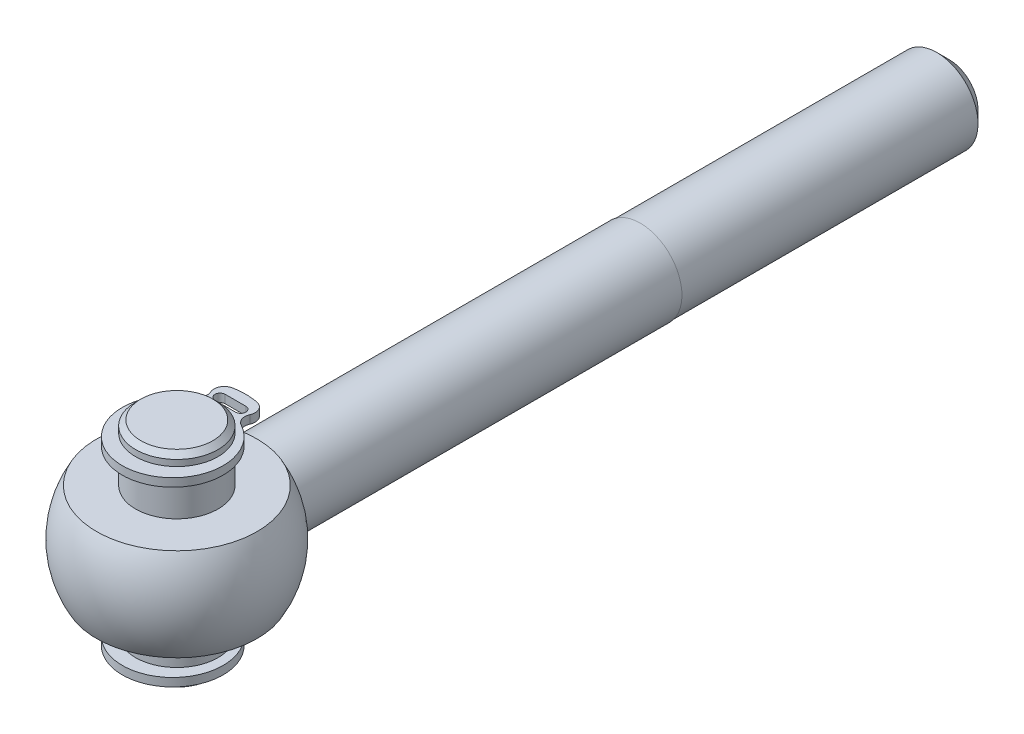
ISO-10303-21;
HEADER;
FILE_DESCRIPTION(('STEP AP214'),'2;1');
FILE_NAME('part.step','',(''),(''),'','','');
FILE_SCHEMA(('AUTOMOTIVE_DESIGN { 1 0 10303 214 1 1 1 1 }'));
ENDSEC;
DATA;
#1=APPLICATION_CONTEXT('core data for automotive mechanical design processes');
#2=APPLICATION_PROTOCOL_DEFINITION('international standard','automotive_design',2000,#1);
#3=PRODUCT_CONTEXT('',#1,'mechanical');
#4=PRODUCT('Part','Part','',(#3));
#5=PRODUCT_RELATED_PRODUCT_CATEGORY('part','',(#4));
#6=PRODUCT_DEFINITION_FORMATION('','',#4);
#7=PRODUCT_DEFINITION_CONTEXT('part definition',#1,'design');
#8=PRODUCT_DEFINITION('design','',#6,#7);
#9=PRODUCT_DEFINITION_SHAPE('','',#8);
#10=(LENGTH_UNIT() NAMED_UNIT(*) SI_UNIT(.MILLI.,.METRE.));
#11=(NAMED_UNIT(*) PLANE_ANGLE_UNIT() SI_UNIT($,.RADIAN.));
#12=(NAMED_UNIT(*) SI_UNIT($,.STERADIAN.) SOLID_ANGLE_UNIT());
#13=UNCERTAINTY_MEASURE_WITH_UNIT(LENGTH_MEASURE(1.E-05),#10,'distance_accuracy_value','');
#14=(GEOMETRIC_REPRESENTATION_CONTEXT(3) GLOBAL_UNCERTAINTY_ASSIGNED_CONTEXT((#13)) GLOBAL_UNIT_ASSIGNED_CONTEXT((#10,
#11,#12)) REPRESENTATION_CONTEXT('',''));
#15=CARTESIAN_POINT('',(0.,0.,0.));
#16=DIRECTION('',(0.,0.,1.));
#17=DIRECTION('',(1.,0.,0.));
#18=AXIS2_PLACEMENT_3D('',#15,#16,#17);
#19=CARTESIAN_POINT('',(1.00001000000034,-8.00000000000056,69.8));
#20=DIRECTION('',(0.,-1.,0.));
#21=DIRECTION('',(0.,0.,-1.));
#22=AXIS2_PLACEMENT_3D('',#19,#20,#21);
#23=CYLINDRICAL_SURFACE('',#22,0.5);
#24=CARTESIAN_POINT('',(1.00001000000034,-8.80000000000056,69.8));
#25=DIRECTION('',(0.,-1.,0.));
#26=DIRECTION('',(0.,0.,-1.));
#27=AXIS2_PLACEMENT_3D('',#24,#25,#26);
#28=CIRCLE('',#27,0.5);
#29=CARTESIAN_POINT('',(0.999999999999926,-8.80000000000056,70.2999999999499));
#30=VERTEX_POINT('',#29);
#31=CARTESIAN_POINT('',(1.00000350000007,-8.80000000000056,69.3000000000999));
#32=VERTEX_POINT('',#31);
#33=EDGE_CURVE('E347',#30,#32,#28,.F.);
#34=ORIENTED_EDGE('',*,*,#33,.F.);
#35=DIRECTION('',(0.,-1.,0.));
#36=VECTOR('',#35,1.);
#37=CARTESIAN_POINT('',(0.999999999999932,-8.00000000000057,70.2999999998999));
#38=LINE('',#37,#36);
#39=CARTESIAN_POINT('',(0.999999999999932,-8.00000000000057,70.2999999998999));
#40=VERTEX_POINT('',#39);
#41=EDGE_CURVE('E289',#40,#30,#38,.T.);
#42=ORIENTED_EDGE('',*,*,#41,.F.);
#43=CARTESIAN_POINT('',(1.00001000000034,-8.00000000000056,69.8));
#44=DIRECTION('',(0.,-1.,0.));
#45=DIRECTION('',(0.,0.,-1.));
#46=AXIS2_PLACEMENT_3D('',#43,#44,#45);
#47=CIRCLE('',#46,0.5);
#48=CARTESIAN_POINT('',(1.00000350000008,-8.00000000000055,69.3000000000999));
#49=VERTEX_POINT('',#48);
#50=EDGE_CURVE('E311',#40,#49,#47,.F.);
#51=ORIENTED_EDGE('',*,*,#50,.T.);
#52=DIRECTION('',(0.,1.,0.));
#53=VECTOR('',#52,1.);
#54=CARTESIAN_POINT('',(0.999999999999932,-8.00000000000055,69.3000000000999));
#55=LINE('',#54,#53);
#56=EDGE_CURVE('E343',#32,#49,#55,.T.);
#57=ORIENTED_EDGE('',*,*,#56,.F.);
#58=EDGE_LOOP('',(#34,#42,#51,#57));
#59=FACE_BOUND('',#58,.T.);
#60=ADVANCED_FACE('F14',(#59),#23,.F.);
#61=CARTESIAN_POINT('',(0.999999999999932,-8.00000000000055,69.3000000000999));
#62=DIRECTION('',(0.,0.,-1.));
#63=DIRECTION('',(0.,1.,0.));
#64=AXIS2_PLACEMENT_3D('',#61,#62,#63);
#65=PLANE('',#64);
#66=ORIENTED_EDGE('',*,*,#56,.T.);
#67=DIRECTION('',(1.,0.,0.));
#68=VECTOR('',#67,1.);
#69=CARTESIAN_POINT('',(0.,-8.00000000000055,69.3000000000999));
#70=LINE('',#69,#68);
#71=CARTESIAN_POINT('',(-1.00000000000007,-8.00000000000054,69.3000000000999));
#72=VERTEX_POINT('',#71);
#73=EDGE_CURVE('E319',#49,#72,#70,.F.);
#74=ORIENTED_EDGE('',*,*,#73,.T.);
#75=DIRECTION('',(0.,-1.,0.));
#76=VECTOR('',#75,1.);
#77=CARTESIAN_POINT('',(-1.00000000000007,-8.00000000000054,69.3000000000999));
#78=LINE('',#77,#76);
#79=CARTESIAN_POINT('',(-1.00000000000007,-8.80000000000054,69.3000000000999));
#80=VERTEX_POINT('',#79);
#81=EDGE_CURVE('E275',#72,#80,#78,.T.);
#82=ORIENTED_EDGE('',*,*,#81,.T.);
#83=DIRECTION('',(1.,0.,0.));
#84=VECTOR('',#83,1.);
#85=CARTESIAN_POINT('',(0.999999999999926,-8.80000000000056,69.3000000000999));
#86=LINE('',#85,#84);
#87=EDGE_CURVE('E272',#32,#80,#86,.F.);
#88=ORIENTED_EDGE('',*,*,#87,.F.);
#89=EDGE_LOOP('',(#66,#74,#82,#88));
#90=FACE_BOUND('',#89,.T.);
#91=ADVANCED_FACE('F486',(#90),#65,.F.);
#92=CARTESIAN_POINT('',(-1.00001000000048,-8.00000000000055,69.8));
#93=DIRECTION('',(0.,-1.,0.));
#94=DIRECTION('',(0.,0.,-1.));
#95=AXIS2_PLACEMENT_3D('',#92,#93,#94);
#96=CYLINDRICAL_SURFACE('',#95,0.5);
#97=CARTESIAN_POINT('',(-1.00001000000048,-8.80000000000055,69.8));
#98=DIRECTION('',(0.,-1.,0.));
#99=DIRECTION('',(0.,0.,-1.));
#100=AXIS2_PLACEMENT_3D('',#97,#98,#99);
#101=CIRCLE('',#100,0.5);
#102=CARTESIAN_POINT('',(-1.00001650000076,-8.80000000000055,70.2999999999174));
#103=VERTEX_POINT('',#102);
#104=EDGE_CURVE('E281',#80,#103,#101,.F.);
#105=ORIENTED_EDGE('',*,*,#104,.F.);
#106=ORIENTED_EDGE('',*,*,#81,.F.);
#107=CARTESIAN_POINT('',(-1.00001000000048,-8.00000000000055,69.8));
#108=DIRECTION('',(0.,-1.,0.));
#109=DIRECTION('',(0.,0.,-1.));
#110=AXIS2_PLACEMENT_3D('',#107,#108,#109);
#111=CIRCLE('',#110,0.5);
#112=CARTESIAN_POINT('',(-1.00001650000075,-8.00000000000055,70.2999999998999));
#113=VERTEX_POINT('',#112);
#114=EDGE_CURVE('E316',#72,#113,#111,.F.);
#115=ORIENTED_EDGE('',*,*,#114,.T.);
#116=DIRECTION('',(0.,-1.,0.));
#117=VECTOR('',#116,1.);
#118=CARTESIAN_POINT('',(-1.0000200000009,-8.00000000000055,70.2999999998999));
#119=LINE('',#118,#117);
#120=EDGE_CURVE('E290',#113,#103,#119,.T.);
#121=ORIENTED_EDGE('',*,*,#120,.T.);
#122=EDGE_LOOP('',(#105,#106,#115,#121));
#123=FACE_BOUND('',#122,.T.);
#124=ADVANCED_FACE('F493',(#123),#96,.F.);
#125=CARTESIAN_POINT('',(0.,-8.00000000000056,70.3));
#126=DIRECTION('',(0.,0.,1.));
#127=DIRECTION('',(0.,-1.,0.));
#128=AXIS2_PLACEMENT_3D('',#125,#126,#127);
#129=PLANE('',#128);
#130=ORIENTED_EDGE('',*,*,#120,.F.);
#131=DIRECTION('',(1.,0.,0.));
#132=VECTOR('',#131,1.);
#133=CARTESIAN_POINT('',(0.,-8.00000000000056,70.2999999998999));
#134=LINE('',#133,#132);
#135=EDGE_CURVE('E315',#113,#40,#134,.T.);
#136=ORIENTED_EDGE('',*,*,#135,.T.);
#137=ORIENTED_EDGE('',*,*,#41,.T.);
#138=DIRECTION('',(1.,0.,0.));
#139=VECTOR('',#138,1.);
#140=CARTESIAN_POINT('',(0.,-8.80000000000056,70.3));
#141=LINE('',#140,#139);
#142=EDGE_CURVE('E287',#103,#30,#141,.T.);
#143=ORIENTED_EDGE('',*,*,#142,.F.);
#144=EDGE_LOOP('',(#130,#136,#137,#143));
#145=FACE_BOUND('',#144,.T.);
#146=ADVANCED_FACE('F499',(#145),#129,.F.);
#147=CARTESIAN_POINT('',(0.,-8.00000000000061,75.));
#148=DIRECTION('',(0.,-1.,0.));
#149=DIRECTION('',(0.,0.,-1.));
#150=AXIS2_PLACEMENT_3D('',#147,#148,#149);
#151=CYLINDRICAL_SURFACE('',#150,6.69621283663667);
#152=CARTESIAN_POINT('',(0.,-8.00000000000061,75.));
#153=DIRECTION('',(0.,-1.,0.));
#154=DIRECTION('',(0.,0.,-1.));
#155=AXIS2_PLACEMENT_3D('',#152,#153,#154);
#156=CIRCLE('',#155,6.69621283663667);
#157=CARTESIAN_POINT('',(-1.17555523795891,-8.00000000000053,68.40778214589));
#158=VERTEX_POINT('',#157);
#159=CARTESIAN_POINT('',(-0.250000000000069,-8.00000000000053,68.3084556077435));
#160=VERTEX_POINT('',#159);
#161=EDGE_CURVE('E291',#158,#160,#156,.T.);
#162=ORIENTED_EDGE('',*,*,#161,.T.);
#163=DIRECTION('',(0.,-1.,0.));
#164=VECTOR('',#163,1.);
#165=CARTESIAN_POINT('',(-0.250000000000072,-8.00000000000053,68.3084556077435));
#166=LINE('',#165,#164);
#167=CARTESIAN_POINT('',(-0.250000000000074,-8.80000000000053,68.3084556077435));
#168=VERTEX_POINT('',#167);
#169=EDGE_CURVE('E592',#160,#168,#166,.T.);
#170=ORIENTED_EDGE('',*,*,#169,.T.);
#171=CARTESIAN_POINT('',(-1.05668095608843E-13,-8.80000000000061,75.));
#172=DIRECTION('',(0.,-1.,0.));
#173=DIRECTION('',(0.,0.,-1.));
#174=AXIS2_PLACEMENT_3D('',#171,#172,#173);
#175=CIRCLE('',#174,6.69621283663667);
#176=CARTESIAN_POINT('',(-1.17555523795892,-8.80000000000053,68.4077821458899));
#177=VERTEX_POINT('',#176);
#178=EDGE_CURVE('E320',#168,#177,#175,.F.);
#179=ORIENTED_EDGE('',*,*,#178,.T.);
#180=DIRECTION('',(0.,-1.,0.));
#181=VECTOR('',#180,1.);
#182=CARTESIAN_POINT('',(-1.17555523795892,-8.00000000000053,68.40778214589));
#183=LINE('',#182,#181);
#184=EDGE_CURVE('E31',#177,#158,#183,.F.);
#185=ORIENTED_EDGE('',*,*,#184,.T.);
#186=EDGE_LOOP('',(#162,#170,#179,#185));
#187=FACE_BOUND('',#186,.T.);
#188=ADVANCED_FACE('F505',(#187),#151,.T.);
#189=CARTESIAN_POINT('',(-0.250000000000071,-8.40000000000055,69.8));
#190=DIRECTION('',(1.,0.,0.));
#191=DIRECTION('',(0.,0.,-1.));
#192=AXIS2_PLACEMENT_3D('',#189,#190,#191);
#193=PLANE('',#192);
#194=DIRECTION('',(0.,0.,-1.));
#195=VECTOR('',#194,1.);
#196=CARTESIAN_POINT('',(-0.250000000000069,-8.0000000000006,73.9825245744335));
#197=LINE('',#196,#195);
#198=CARTESIAN_POINT('',(-0.250000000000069,-8.00000000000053,68.3));
#199=VERTEX_POINT('',#198);
#200=EDGE_CURVE('E314',#160,#199,#197,.T.);
#201=ORIENTED_EDGE('',*,*,#200,.T.);
#202=DIRECTION('',(0.,1.,0.));
#203=VECTOR('',#202,1.);
#204=CARTESIAN_POINT('',(-0.250000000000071,-8.40000000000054,68.3));
#205=LINE('',#204,#203);
#206=CARTESIAN_POINT('',(-0.250000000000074,-8.80000000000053,68.3));
#207=VERTEX_POINT('',#206);
#208=EDGE_CURVE('E619',#199,#207,#205,.F.);
#209=ORIENTED_EDGE('',*,*,#208,.T.);
#210=DIRECTION('',(0.,0.,-1.));
#211=VECTOR('',#210,1.);
#212=CARTESIAN_POINT('',(-0.250000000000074,-8.80000000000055,69.8));
#213=LINE('',#212,#211);
#214=EDGE_CURVE('E346',#168,#207,#213,.T.);
#215=ORIENTED_EDGE('',*,*,#214,.F.);
#216=ORIENTED_EDGE('',*,*,#169,.F.);
#217=EDGE_LOOP('',(#201,#209,#215,#216));
#218=FACE_BOUND('',#217,.T.);
#219=ADVANCED_FACE('F501',(#218),#193,.F.);
#220=CARTESIAN_POINT('',(0.,-8.40000000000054,68.3));
#221=DIRECTION('',(0.,0.,1.));
#222=DIRECTION('',(1.,0.,0.));
#223=AXIS2_PLACEMENT_3D('',#220,#221,#222);
#224=PLANE('',#223);
#225=DIRECTION('',(1.,0.,0.));
#226=VECTOR('',#225,1.);
#227=CARTESIAN_POINT('',(0.,-8.80000000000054,68.3));
#228=LINE('',#227,#226);
#229=CARTESIAN_POINT('',(0.249999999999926,-8.80000000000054,68.3));
#230=VERTEX_POINT('',#229);
#231=EDGE_CURVE('E611',#207,#230,#228,.T.);
#232=ORIENTED_EDGE('',*,*,#231,.F.);
#233=ORIENTED_EDGE('',*,*,#208,.F.);
#234=DIRECTION('',(1.,0.,0.));
#235=VECTOR('',#234,1.);
#236=CARTESIAN_POINT('',(0.,-8.00000000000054,68.3));
#237=LINE('',#236,#235);
#238=CARTESIAN_POINT('',(0.249999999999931,-8.00000000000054,68.3));
#239=VERTEX_POINT('',#238);
#240=EDGE_CURVE('E614',#199,#239,#237,.T.);
#241=ORIENTED_EDGE('',*,*,#240,.T.);
#242=DIRECTION('',(0.,1.,0.));
#243=VECTOR('',#242,1.);
#244=CARTESIAN_POINT('',(0.249999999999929,-8.40000000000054,68.3));
#245=LINE('',#244,#243);
#246=EDGE_CURVE('E608',#239,#230,#245,.F.);
#247=ORIENTED_EDGE('',*,*,#246,.T.);
#248=EDGE_LOOP('',(#232,#233,#241,#247));
#249=FACE_BOUND('',#248,.T.);
#250=ADVANCED_FACE('F504',(#249),#224,.F.);
#251=CARTESIAN_POINT('',(0.249999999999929,-8.40000000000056,69.8));
#252=DIRECTION('',(-1.,0.,0.));
#253=DIRECTION('',(0.,0.,1.));
#254=AXIS2_PLACEMENT_3D('',#251,#252,#253);
#255=PLANE('',#254);
#256=DIRECTION('',(0.,0.,1.));
#257=VECTOR('',#256,1.);
#258=CARTESIAN_POINT('',(0.249999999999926,-8.80000000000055,69.8));
#259=LINE('',#258,#257);
#260=CARTESIAN_POINT('',(0.249999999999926,-8.80000000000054,68.3084556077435));
#261=VERTEX_POINT('',#260);
#262=EDGE_CURVE('E342',#230,#261,#259,.T.);
#263=ORIENTED_EDGE('',*,*,#262,.F.);
#264=ORIENTED_EDGE('',*,*,#246,.F.);
#265=DIRECTION('',(0.,0.,-1.));
#266=VECTOR('',#265,1.);
#267=CARTESIAN_POINT('',(0.249999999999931,-8.0000000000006,73.9825245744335));
#268=LINE('',#267,#266);
#269=CARTESIAN_POINT('',(0.249999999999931,-8.00000000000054,68.3084556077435));
#270=VERTEX_POINT('',#269);
#271=EDGE_CURVE('E310',#239,#270,#268,.F.);
#272=ORIENTED_EDGE('',*,*,#271,.T.);
#273=DIRECTION('',(0.,-1.,0.));
#274=VECTOR('',#273,1.);
#275=CARTESIAN_POINT('',(0.249999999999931,-8.00000000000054,68.3084556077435));
#276=LINE('',#275,#274);
#277=EDGE_CURVE('E339',#261,#270,#276,.F.);
#278=ORIENTED_EDGE('',*,*,#277,.F.);
#279=EDGE_LOOP('',(#263,#264,#272,#278));
#280=FACE_BOUND('',#279,.T.);
#281=ADVANCED_FACE('F509',(#280),#255,.F.);
#282=CARTESIAN_POINT('',(0.,-8.00000000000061,75.));
#283=DIRECTION('',(0.,-1.,0.));
#284=DIRECTION('',(0.,0.,-1.));
#285=AXIS2_PLACEMENT_3D('',#282,#283,#284);
#286=CYLINDRICAL_SURFACE('',#285,6.69621283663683);
#287=CARTESIAN_POINT('',(0.,-8.00000000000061,75.));
#288=DIRECTION('',(0.,-1.,0.));
#289=DIRECTION('',(0.,0.,-1.));
#290=AXIS2_PLACEMENT_3D('',#287,#288,#289);
#291=CIRCLE('',#290,6.69621283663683);
#292=CARTESIAN_POINT('',(1.17555523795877,-8.00000000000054,68.4077821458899));
#293=VERTEX_POINT('',#292);
#294=EDGE_CURVE('E307',#270,#293,#291,.T.);
#295=ORIENTED_EDGE('',*,*,#294,.T.);
#296=DIRECTION('',(0.,-1.,0.));
#297=VECTOR('',#296,1.);
#298=CARTESIAN_POINT('',(1.17555523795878,-8.00000000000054,68.40778214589));
#299=LINE('',#298,#297);
#300=CARTESIAN_POINT('',(1.17555523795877,-8.80000000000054,68.4077821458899));
#301=VERTEX_POINT('',#300);
#302=EDGE_CURVE('E338',#301,#293,#299,.F.);
#303=ORIENTED_EDGE('',*,*,#302,.F.);
#304=CARTESIAN_POINT('',(0.,-8.80000000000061,75.));
#305=DIRECTION('',(0.,-1.,0.));
#306=DIRECTION('',(0.,0.,-1.));
#307=AXIS2_PLACEMENT_3D('',#304,#305,#306);
#308=CIRCLE('',#307,6.69621283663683);
#309=EDGE_CURVE('E340',#301,#261,#308,.F.);
#310=ORIENTED_EDGE('',*,*,#309,.T.);
#311=ORIENTED_EDGE('',*,*,#277,.T.);
#312=EDGE_LOOP('',(#295,#303,#310,#311));
#313=FACE_BOUND('',#312,.T.);
#314=ADVANCED_FACE('F513',(#313),#286,.T.);
#315=CARTESIAN_POINT('',(0.999999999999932,-8.00000000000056,69.3922517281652));
#316=DIRECTION('',(0.,-1.,0.));
#317=DIRECTION('',(0.,0.,-1.));
#318=AXIS2_PLACEMENT_3D('',#315,#316,#317);
#319=CYLINDRICAL_SURFACE('',#318,1.);
#320=CARTESIAN_POINT('',(0.999999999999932,-8.00000000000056,69.3922517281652));
#321=DIRECTION('',(0.,-1.,0.));
#322=DIRECTION('',(0.,0.,-1.));
#323=AXIS2_PLACEMENT_3D('',#320,#321,#322);
#324=CIRCLE('',#323,1.);
#325=CARTESIAN_POINT('',(1.91071061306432,-8.00000000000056,69.8052967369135));
#326=VERTEX_POINT('',#325);
#327=EDGE_CURVE('E304',#293,#326,#324,.T.);
#328=ORIENTED_EDGE('',*,*,#327,.T.);
#329=DIRECTION('',(0.,-1.,0.));
#330=VECTOR('',#329,1.);
#331=CARTESIAN_POINT('',(1.91071061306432,-8.00000000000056,69.8052967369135));
#332=LINE('',#331,#330);
#333=CARTESIAN_POINT('',(1.91071061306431,-8.80000000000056,69.8052967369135));
#334=VERTEX_POINT('',#333);
#335=EDGE_CURVE('E335',#326,#334,#332,.T.);
#336=ORIENTED_EDGE('',*,*,#335,.T.);
#337=CARTESIAN_POINT('',(0.999999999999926,-8.80000000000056,69.3922517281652));
#338=DIRECTION('',(0.,-1.,0.));
#339=DIRECTION('',(0.,0.,-1.));
#340=AXIS2_PLACEMENT_3D('',#337,#338,#339);
#341=CIRCLE('',#340,1.);
#342=EDGE_CURVE('E336',#334,#301,#341,.F.);
#343=ORIENTED_EDGE('',*,*,#342,.T.);
#344=ORIENTED_EDGE('',*,*,#302,.T.);
#345=EDGE_LOOP('',(#328,#336,#343,#344));
#346=FACE_BOUND('',#345,.T.);
#347=ADVANCED_FACE('F517',(#346),#319,.T.);
#348=CARTESIAN_POINT('',(2.8214212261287,-8.00000000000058,70.2183417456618));
#349=DIRECTION('',(0.,-1.,0.));
#350=DIRECTION('',(0.,0.,-1.));
#351=AXIS2_PLACEMENT_3D('',#348,#349,#350);
#352=CYLINDRICAL_SURFACE('',#351,1.);
#353=ORIENTED_EDGE('',*,*,#335,.F.);
#354=CARTESIAN_POINT('',(2.8214212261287,-8.00000000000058,70.2183417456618));
#355=DIRECTION('',(0.,-1.,0.));
#356=DIRECTION('',(0.,0.,-1.));
#357=AXIS2_PLACEMENT_3D('',#354,#355,#356);
#358=CIRCLE('',#357,1.);
#359=CARTESIAN_POINT('',(2.34321423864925,-8.00000000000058,71.0965889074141));
#360=VERTEX_POINT('',#359);
#361=EDGE_CURVE('E301',#326,#360,#358,.F.);
#362=ORIENTED_EDGE('',*,*,#361,.T.);
#363=DIRECTION('',(0.,-1.,0.));
#364=VECTOR('',#363,1.);
#365=CARTESIAN_POINT('',(2.34321423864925,-8.00000000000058,71.0965889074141));
#366=LINE('',#365,#364);
#367=CARTESIAN_POINT('',(2.34321423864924,-8.80000000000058,71.0965889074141));
#368=VERTEX_POINT('',#367);
#369=EDGE_CURVE('E331',#368,#360,#366,.F.);
#370=ORIENTED_EDGE('',*,*,#369,.F.);
#371=CARTESIAN_POINT('',(2.8214212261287,-8.80000000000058,70.2183417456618));
#372=DIRECTION('',(0.,-1.,0.));
#373=DIRECTION('',(0.,0.,-1.));
#374=AXIS2_PLACEMENT_3D('',#371,#372,#373);
#375=CIRCLE('',#374,1.);
#376=EDGE_CURVE('E332',#334,#368,#375,.F.);
#377=ORIENTED_EDGE('',*,*,#376,.F.);
#378=EDGE_LOOP('',(#353,#362,#370,#377));
#379=FACE_BOUND('',#378,.T.);
#380=ADVANCED_FACE('F521',(#379),#352,.F.);
#381=CARTESIAN_POINT('',(0.,-8.00000000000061,75.4));
#382=DIRECTION('',(0.,-1.,0.));
#383=DIRECTION('',(0.,0.,-1.));
#384=AXIS2_PLACEMENT_3D('',#381,#382,#383);
#385=CYLINDRICAL_SURFACE('',#384,4.9);
#386=DIRECTION('',(0.,-1.,0.));
#387=VECTOR('',#386,1.);
#388=CARTESIAN_POINT('',(-2.3432142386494,-8.00000000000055,71.0965889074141));
#389=LINE('',#388,#387);
#390=CARTESIAN_POINT('',(-2.3432142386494,-8.00000000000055,71.0965889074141));
#391=VERTEX_POINT('',#390);
#392=CARTESIAN_POINT('',(-2.3432142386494,-8.80000000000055,71.0965889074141));
#393=VERTEX_POINT('',#392);
#394=EDGE_CURVE('E328',#391,#393,#389,.T.);
#395=ORIENTED_EDGE('',*,*,#394,.T.);
#396=CARTESIAN_POINT('',(0.,-8.80000000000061,75.4));
#397=DIRECTION('',(0.,-1.,0.));
#398=DIRECTION('',(0.,0.,-1.));
#399=AXIS2_PLACEMENT_3D('',#396,#397,#398);
#400=CIRCLE('',#399,4.9);
#401=EDGE_CURVE('E329',#393,#368,#400,.F.);
#402=ORIENTED_EDGE('',*,*,#401,.T.);
#403=ORIENTED_EDGE('',*,*,#369,.T.);
#404=CARTESIAN_POINT('',(0.,-8.00000000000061,75.4));
#405=DIRECTION('',(0.,-1.,0.));
#406=DIRECTION('',(0.,0.,-1.));
#407=AXIS2_PLACEMENT_3D('',#404,#405,#406);
#408=CIRCLE('',#407,4.9);
#409=EDGE_CURVE('E299',#360,#391,#408,.T.);
#410=ORIENTED_EDGE('',*,*,#409,.T.);
#411=EDGE_LOOP('',(#395,#402,#403,#410));
#412=FACE_BOUND('',#411,.T.);
#413=ADVANCED_FACE('F525',(#412),#385,.T.);
#414=CARTESIAN_POINT('',(-2.82142122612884,-8.00000000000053,70.2183417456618));
#415=DIRECTION('',(0.,-1.,0.));
#416=DIRECTION('',(0.,0.,-1.));
#417=AXIS2_PLACEMENT_3D('',#414,#415,#416);
#418=CYLINDRICAL_SURFACE('',#417,1.);
#419=ORIENTED_EDGE('',*,*,#394,.F.);
#420=CARTESIAN_POINT('',(-2.82142122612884,-8.00000000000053,70.2183417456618));
#421=DIRECTION('',(0.,-1.,0.));
#422=DIRECTION('',(0.,0.,-1.));
#423=AXIS2_PLACEMENT_3D('',#420,#421,#422);
#424=CIRCLE('',#423,1.);
#425=CARTESIAN_POINT('',(-1.91071061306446,-8.00000000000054,69.8052967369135));
#426=VERTEX_POINT('',#425);
#427=EDGE_CURVE('E296',#391,#426,#424,.F.);
#428=ORIENTED_EDGE('',*,*,#427,.T.);
#429=DIRECTION('',(0.,-1.,0.));
#430=VECTOR('',#429,1.);
#431=CARTESIAN_POINT('',(-1.91071061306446,-8.00000000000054,69.8052967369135));
#432=LINE('',#431,#430);
#433=CARTESIAN_POINT('',(-1.91071061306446,-8.80000000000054,69.8052967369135));
#434=VERTEX_POINT('',#433);
#435=EDGE_CURVE('E322',#434,#426,#432,.F.);
#436=ORIENTED_EDGE('',*,*,#435,.F.);
#437=CARTESIAN_POINT('',(-2.82142122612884,-8.80000000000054,70.2183417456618));
#438=DIRECTION('',(0.,-1.,0.));
#439=DIRECTION('',(0.,0.,-1.));
#440=AXIS2_PLACEMENT_3D('',#437,#438,#439);
#441=CIRCLE('',#440,1.);
#442=EDGE_CURVE('E325',#393,#434,#441,.F.);
#443=ORIENTED_EDGE('',*,*,#442,.F.);
#444=EDGE_LOOP('',(#419,#428,#436,#443));
#445=FACE_BOUND('',#444,.T.);
#446=ADVANCED_FACE('F529',(#445),#418,.F.);
#447=CARTESIAN_POINT('',(-1.00000000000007,-8.00000000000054,69.3922517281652));
#448=DIRECTION('',(0.,-1.,0.));
#449=DIRECTION('',(0.,0.,-1.));
#450=AXIS2_PLACEMENT_3D('',#447,#448,#449);
#451=CYLINDRICAL_SURFACE('',#450,1.);
#452=CARTESIAN_POINT('',(-1.00000000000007,-8.00000000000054,69.3922517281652));
#453=DIRECTION('',(0.,-1.,0.));
#454=DIRECTION('',(0.,0.,-1.));
#455=AXIS2_PLACEMENT_3D('',#452,#453,#454);
#456=CIRCLE('',#455,1.);
#457=EDGE_CURVE('E293',#426,#158,#456,.T.);
#458=ORIENTED_EDGE('',*,*,#457,.T.);
#459=ORIENTED_EDGE('',*,*,#184,.F.);
#460=CARTESIAN_POINT('',(-1.00000000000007,-8.80000000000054,69.3922517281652));
#461=DIRECTION('',(0.,-1.,0.));
#462=DIRECTION('',(0.,0.,-1.));
#463=AXIS2_PLACEMENT_3D('',#460,#461,#462);
#464=CIRCLE('',#463,1.);
#465=EDGE_CURVE('E323',#177,#434,#464,.F.);
#466=ORIENTED_EDGE('',*,*,#465,.T.);
#467=ORIENTED_EDGE('',*,*,#435,.T.);
#468=EDGE_LOOP('',(#458,#459,#466,#467));
#469=FACE_BOUND('',#468,.T.);
#470=ADVANCED_FACE('F533',(#469),#451,.T.);
#471=CARTESIAN_POINT('',(0.,-8.0000000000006,73.9825245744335));
#472=DIRECTION('',(0.,-1.,0.));
#473=DIRECTION('',(0.,0.,-1.));
#474=AXIS2_PLACEMENT_3D('',#471,#472,#473);
#475=PLANE('',#474);
#476=CARTESIAN_POINT('',(0.,-8.00000000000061,75.));
#477=DIRECTION('',(0.,-1.,0.));
#478=DIRECTION('',(0.,0.,1.));
#479=AXIS2_PLACEMENT_3D('',#476,#477,#478);
#480=CIRCLE('',#479,4.);
#481=CARTESIAN_POINT('',(0.,-8.00000000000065,79.));
#482=VERTEX_POINT('',#481);
#483=EDGE_CURVE('E23',#482,#482,#480,.T.);
#484=ORIENTED_EDGE('',*,*,#483,.T.);
#485=EDGE_LOOP('',(#484));
#486=FACE_BOUND('',#485,.T.);
#487=ORIENTED_EDGE('',*,*,#457,.F.);
#488=ORIENTED_EDGE('',*,*,#427,.F.);
#489=ORIENTED_EDGE('',*,*,#409,.F.);
#490=ORIENTED_EDGE('',*,*,#361,.F.);
#491=ORIENTED_EDGE('',*,*,#327,.F.);
#492=ORIENTED_EDGE('',*,*,#294,.F.);
#493=ORIENTED_EDGE('',*,*,#271,.F.);
#494=ORIENTED_EDGE('',*,*,#240,.F.);
#495=ORIENTED_EDGE('',*,*,#200,.F.);
#496=ORIENTED_EDGE('',*,*,#161,.F.);
#497=EDGE_LOOP('',(#487,#488,#489,#490,#491,#492,#493,#494,#495,#496));
#498=FACE_BOUND('',#497,.T.);
#499=ORIENTED_EDGE('',*,*,#135,.F.);
#500=ORIENTED_EDGE('',*,*,#114,.F.);
#501=ORIENTED_EDGE('',*,*,#73,.F.);
#502=ORIENTED_EDGE('',*,*,#50,.F.);
#503=EDGE_LOOP('',(#499,#500,#501,#502));
#504=FACE_BOUND('',#503,.T.);
#505=ADVANCED_FACE('F537',(#486,#498,#504),#475,.F.);
#506=CARTESIAN_POINT('',(0.,-8.8000000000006,73.9825245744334));
#507=DIRECTION('',(0.,-1.,0.));
#508=DIRECTION('',(0.,0.,-1.));
#509=AXIS2_PLACEMENT_3D('',#506,#507,#508);
#510=PLANE('',#509);
#511=CARTESIAN_POINT('',(0.,-8.80000000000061,75.));
#512=DIRECTION('',(0.,-1.,0.));
#513=DIRECTION('',(0.,0.,1.));
#514=AXIS2_PLACEMENT_3D('',#511,#512,#513);
#515=CIRCLE('',#514,3.8);
#516=CARTESIAN_POINT('',(0.,-8.80000000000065,78.8));
#517=VERTEX_POINT('',#516);
#518=EDGE_CURVE('E9',#517,#517,#515,.T.);
#519=ORIENTED_EDGE('',*,*,#518,.F.);
#520=EDGE_LOOP('',(#519));
#521=FACE_BOUND('',#520,.T.);
#522=ORIENTED_EDGE('',*,*,#465,.F.);
#523=ORIENTED_EDGE('',*,*,#178,.F.);
#524=ORIENTED_EDGE('',*,*,#214,.T.);
#525=ORIENTED_EDGE('',*,*,#231,.T.);
#526=ORIENTED_EDGE('',*,*,#262,.T.);
#527=ORIENTED_EDGE('',*,*,#309,.F.);
#528=ORIENTED_EDGE('',*,*,#342,.F.);
#529=ORIENTED_EDGE('',*,*,#376,.T.);
#530=ORIENTED_EDGE('',*,*,#401,.F.);
#531=ORIENTED_EDGE('',*,*,#442,.T.);
#532=EDGE_LOOP('',(#522,#523,#524,#525,#526,#527,#528,#529,#530,#531));
#533=FACE_BOUND('',#532,.T.);
#534=ORIENTED_EDGE('',*,*,#104,.T.);
#535=ORIENTED_EDGE('',*,*,#142,.T.);
#536=ORIENTED_EDGE('',*,*,#33,.T.);
#537=ORIENTED_EDGE('',*,*,#87,.T.);
#538=EDGE_LOOP('',(#534,#535,#536,#537));
#539=FACE_BOUND('',#538,.T.);
#540=ADVANCED_FACE('F542',(#521,#533,#539),#510,.T.);
#541=CARTESIAN_POINT('',(0.,10.,75.));
#542=DIRECTION('',(0.,1.,0.));
#543=DIRECTION('',(0.,0.,-1.));
#544=AXIS2_PLACEMENT_3D('',#541,#542,#543);
#545=PLANE('',#544);
#546=CARTESIAN_POINT('',(0.,10.,75.));
#547=DIRECTION('',(0.,1.,0.));
#548=DIRECTION('',(0.,0.,-1.));
#549=AXIS2_PLACEMENT_3D('',#546,#547,#548);
#550=CIRCLE('',#549,3.5);
#551=CARTESIAN_POINT('',(0.,10.,71.5));
#552=VERTEX_POINT('',#551);
#553=EDGE_CURVE('E240',#552,#552,#550,.T.);
#554=ORIENTED_EDGE('',*,*,#553,.T.);
#555=EDGE_LOOP('',(#554));
#556=FACE_BOUND('',#555,.T.);
#557=ADVANCED_FACE('F565',(#556),#545,.T.);
#558=CARTESIAN_POINT('',(0.,10.,75.));
#559=DIRECTION('',(0.,-1.,0.));
#560=DIRECTION('',(0.,0.,1.));
#561=AXIS2_PLACEMENT_3D('',#558,#559,#560);
#562=CONICAL_SURFACE('',#561,3.5,0.785398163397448);
#563=CARTESIAN_POINT('',(0.,9.5,75.));
#564=DIRECTION('',(0.,1.,0.));
#565=DIRECTION('',(0.,0.,-1.));
#566=AXIS2_PLACEMENT_3D('',#563,#564,#565);
#567=CIRCLE('',#566,4.);
#568=CARTESIAN_POINT('',(0.,9.5,71.));
#569=VERTEX_POINT('',#568);
#570=EDGE_CURVE('E243',#569,#569,#567,.F.);
#571=ORIENTED_EDGE('',*,*,#570,.F.);
#572=EDGE_LOOP('',(#571));
#573=FACE_BOUND('',#572,.T.);
#574=ORIENTED_EDGE('',*,*,#553,.F.);
#575=EDGE_LOOP('',(#574));
#576=FACE_BOUND('',#575,.T.);
#577=ADVANCED_FACE('F572',(#573,#576),#562,.T.);
#578=CARTESIAN_POINT('',(0.,-10.,75.));
#579=DIRECTION('',(0.,1.,0.));
#580=DIRECTION('',(0.,0.,-1.));
#581=AXIS2_PLACEMENT_3D('',#578,#579,#580);
#582=CYLINDRICAL_SURFACE('',#581,4.);
#583=ORIENTED_EDGE('',*,*,#570,.T.);
#584=EDGE_LOOP('',(#583));
#585=FACE_BOUND('',#584,.T.);
#586=CARTESIAN_POINT('',(0.,8.9,75.));
#587=DIRECTION('',(0.,1.,0.));
#588=DIRECTION('',(0.,0.,-1.));
#589=AXIS2_PLACEMENT_3D('',#586,#587,#588);
#590=CIRCLE('',#589,4.);
#591=CARTESIAN_POINT('',(0.,8.9,71.));
#592=VERTEX_POINT('',#591);
#593=EDGE_CURVE('E226',#592,#592,#590,.T.);
#594=ORIENTED_EDGE('',*,*,#593,.T.);
#595=EDGE_LOOP('',(#594));
#596=FACE_BOUND('',#595,.T.);
#597=ADVANCED_FACE('F575',(#585,#596),#582,.T.);
#598=CARTESIAN_POINT('',(0.,8.9,75.));
#599=DIRECTION('',(0.,1.,0.));
#600=DIRECTION('',(0.,0.,-1.));
#601=AXIS2_PLACEMENT_3D('',#598,#599,#600);
#602=PLANE('',#601);
#603=ORIENTED_EDGE('',*,*,#593,.F.);
#604=EDGE_LOOP('',(#603));
#605=FACE_BOUND('',#604,.T.);
#606=CARTESIAN_POINT('',(0.,8.9,75.));
#607=DIRECTION('',(0.,1.,0.));
#608=DIRECTION('',(0.,0.,-1.));
#609=AXIS2_PLACEMENT_3D('',#606,#607,#608);
#610=CIRCLE('',#609,3.8);
#611=CARTESIAN_POINT('',(0.,8.9,71.2));
#612=VERTEX_POINT('',#611);
#613=EDGE_CURVE('E223',#612,#612,#610,.T.);
#614=ORIENTED_EDGE('',*,*,#613,.T.);
#615=EDGE_LOOP('',(#614));
#616=FACE_BOUND('',#615,.T.);
#617=ADVANCED_FACE('F576',(#605,#616),#602,.F.);
#618=CARTESIAN_POINT('',(0.,8.9,75.));
#619=DIRECTION('',(0.,-1.,0.));
#620=DIRECTION('',(0.,0.,1.));
#621=AXIS2_PLACEMENT_3D('',#618,#619,#620);
#622=CYLINDRICAL_SURFACE('',#621,3.8);
#623=CARTESIAN_POINT('',(0.,8.80000000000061,75.));
#624=DIRECTION('',(0.,1.,0.));
#625=DIRECTION('',(0.,0.,-1.));
#626=AXIS2_PLACEMENT_3D('',#623,#624,#625);
#627=CIRCLE('',#626,3.8);
#628=CARTESIAN_POINT('',(0.,8.80000000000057,71.2));
#629=VERTEX_POINT('',#628);
#630=EDGE_CURVE('E233',#629,#629,#627,.F.);
#631=ORIENTED_EDGE('',*,*,#630,.F.);
#632=EDGE_LOOP('',(#631));
#633=FACE_BOUND('',#632,.T.);
#634=ORIENTED_EDGE('',*,*,#613,.F.);
#635=EDGE_LOOP('',(#634));
#636=FACE_BOUND('',#635,.T.);
#637=ADVANCED_FACE('F556',(#633,#636),#622,.T.);
#638=CARTESIAN_POINT('',(-2.8,0.,0.));
#639=DIRECTION('',(0.,0.,-1.));
#640=DIRECTION('',(0.,-1.,0.));
#641=AXIS2_PLACEMENT_3D('',#638,#639,#640);
#642=PLANE('',#641);
#643=CARTESIAN_POINT('',(0.,0.,0.));
#644=DIRECTION('',(0.,0.,1.));
#645=DIRECTION('',(0.,1.,0.));
#646=AXIS2_PLACEMENT_3D('',#643,#644,#645);
#647=CIRCLE('',#646,2.8);
#648=CARTESIAN_POINT('',(0.,2.8,0.));
#649=VERTEX_POINT('',#648);
#650=EDGE_CURVE('E260',#649,#649,#647,.T.);
#651=ORIENTED_EDGE('',*,*,#650,.F.);
#652=EDGE_LOOP('',(#651));
#653=FACE_BOUND('',#652,.T.);
#654=ADVANCED_FACE('F546',(#653),#642,.T.);
#655=CARTESIAN_POINT('',(0.,8.8000000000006,73.9825245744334));
#656=DIRECTION('',(0.,1.,0.));
#657=DIRECTION('',(0.,0.,-1.));
#658=AXIS2_PLACEMENT_3D('',#655,#656,#657);
#659=PLANE('',#658);
#660=CARTESIAN_POINT('',(1.0000100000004,8.80000000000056,69.8));
#661=DIRECTION('',(0.,1.,0.));
#662=DIRECTION('',(0.,0.,-1.));
#663=AXIS2_PLACEMENT_3D('',#660,#661,#662);
#664=CIRCLE('',#663,0.5);
#665=CARTESIAN_POINT('',(1.,8.80000000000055,69.3000000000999));
#666=VERTEX_POINT('',#665);
#667=CARTESIAN_POINT('',(1.00001650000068,8.80000000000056,70.2999999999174));
#668=VERTEX_POINT('',#667);
#669=EDGE_CURVE('E188',#666,#668,#664,.F.);
#670=ORIENTED_EDGE('',*,*,#669,.T.);
#671=DIRECTION('',(-1.,0.,0.));
#672=VECTOR('',#671,1.);
#673=CARTESIAN_POINT('',(0.,8.80000000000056,70.3));
#674=LINE('',#673,#672);
#675=CARTESIAN_POINT('',(-1.,8.80000000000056,70.2999999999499));
#676=VERTEX_POINT('',#675);
#677=EDGE_CURVE('E192',#668,#676,#674,.T.);
#678=ORIENTED_EDGE('',*,*,#677,.T.);
#679=CARTESIAN_POINT('',(-1.00001000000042,8.80000000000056,69.8));
#680=DIRECTION('',(0.,1.,0.));
#681=DIRECTION('',(0.,0.,-1.));
#682=AXIS2_PLACEMENT_3D('',#679,#680,#681);
#683=CIRCLE('',#682,0.5);
#684=CARTESIAN_POINT('',(-1.00000350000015,8.80000000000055,69.3000000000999));
#685=VERTEX_POINT('',#684);
#686=EDGE_CURVE('E213',#676,#685,#683,.F.);
#687=ORIENTED_EDGE('',*,*,#686,.T.);
#688=DIRECTION('',(-1.,0.,0.));
#689=VECTOR('',#688,1.);
#690=CARTESIAN_POINT('',(-1.,8.80000000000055,69.3000000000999));
#691=LINE('',#690,#689);
#692=EDGE_CURVE('E186',#685,#666,#691,.F.);
#693=ORIENTED_EDGE('',*,*,#692,.T.);
#694=EDGE_LOOP('',(#670,#678,#687,#693));
#695=FACE_BOUND('',#694,.T.);
#696=CARTESIAN_POINT('',(1.,8.80000000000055,69.3922517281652));
#697=DIRECTION('',(0.,1.,0.));
#698=DIRECTION('',(0.,0.,-1.));
#699=AXIS2_PLACEMENT_3D('',#696,#697,#698);
#700=CIRCLE('',#699,1.);
#701=CARTESIAN_POINT('',(1.17555523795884,8.80000000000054,68.4077821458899));
#702=VERTEX_POINT('',#701);
#703=CARTESIAN_POINT('',(1.91071061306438,8.80000000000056,69.8052967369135));
#704=VERTEX_POINT('',#703);
#705=EDGE_CURVE('E380',#702,#704,#700,.F.);
#706=ORIENTED_EDGE('',*,*,#705,.F.);
#707=CARTESIAN_POINT('',(0.,8.80000000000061,75.));
#708=DIRECTION('',(0.,1.,0.));
#709=DIRECTION('',(0.,0.,-1.));
#710=AXIS2_PLACEMENT_3D('',#707,#708,#709);
#711=CIRCLE('',#710,6.69621283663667);
#712=CARTESIAN_POINT('',(0.249999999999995,8.80000000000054,68.3084556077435));
#713=VERTEX_POINT('',#712);
#714=EDGE_CURVE('E375',#713,#702,#711,.F.);
#715=ORIENTED_EDGE('',*,*,#714,.F.);
#716=DIRECTION('',(0.,0.,-1.));
#717=VECTOR('',#716,1.);
#718=CARTESIAN_POINT('',(0.249999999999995,8.80000000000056,69.8));
#719=LINE('',#718,#717);
#720=CARTESIAN_POINT('',(0.249999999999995,8.80000000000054,68.3));
#721=VERTEX_POINT('',#720);
#722=EDGE_CURVE('E412',#713,#721,#719,.T.);
#723=ORIENTED_EDGE('',*,*,#722,.T.);
#724=DIRECTION('',(-1.,0.,0.));
#725=VECTOR('',#724,1.);
#726=CARTESIAN_POINT('',(0.,8.80000000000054,68.3));
#727=LINE('',#726,#725);
#728=CARTESIAN_POINT('',(-0.250000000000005,8.80000000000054,68.3));
#729=VERTEX_POINT('',#728);
#730=EDGE_CURVE('E402',#721,#729,#727,.T.);
#731=ORIENTED_EDGE('',*,*,#730,.T.);
#732=DIRECTION('',(0.,0.,1.));
#733=VECTOR('',#732,1.);
#734=CARTESIAN_POINT('',(-0.250000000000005,8.80000000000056,69.8));
#735=LINE('',#734,#733);
#736=CARTESIAN_POINT('',(-0.250000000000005,8.80000000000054,68.3084556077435));
#737=VERTEX_POINT('',#736);
#738=EDGE_CURVE('E401',#729,#737,#735,.T.);
#739=ORIENTED_EDGE('',*,*,#738,.T.);
#740=CARTESIAN_POINT('',(0.,8.80000000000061,75.));
#741=DIRECTION('',(0.,1.,0.));
#742=DIRECTION('',(0.,0.,-1.));
#743=AXIS2_PLACEMENT_3D('',#740,#741,#742);
#744=CIRCLE('',#743,6.69621283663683);
#745=CARTESIAN_POINT('',(-1.17555523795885,8.80000000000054,68.4077821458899));
#746=VERTEX_POINT('',#745);
#747=EDGE_CURVE('E397',#746,#737,#744,.F.);
#748=ORIENTED_EDGE('',*,*,#747,.F.);
#749=CARTESIAN_POINT('',(-1.,8.80000000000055,69.3922517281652));
#750=DIRECTION('',(0.,1.,0.));
#751=DIRECTION('',(0.,0.,-1.));
#752=AXIS2_PLACEMENT_3D('',#749,#750,#751);
#753=CIRCLE('',#752,1.);
#754=CARTESIAN_POINT('',(-1.91071061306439,8.80000000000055,69.8052967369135));
#755=VERTEX_POINT('',#754);
#756=EDGE_CURVE('E394',#755,#746,#753,.F.);
#757=ORIENTED_EDGE('',*,*,#756,.F.);
#758=CARTESIAN_POINT('',(-2.82142122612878,8.80000000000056,70.2183417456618));
#759=DIRECTION('',(0.,1.,0.));
#760=DIRECTION('',(0.,0.,-1.));
#761=AXIS2_PLACEMENT_3D('',#758,#759,#760);
#762=CIRCLE('',#761,1.);
#763=CARTESIAN_POINT('',(-2.34321423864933,8.80000000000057,71.0965889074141));
#764=VERTEX_POINT('',#763);
#765=EDGE_CURVE('E388',#755,#764,#762,.F.);
#766=ORIENTED_EDGE('',*,*,#765,.T.);
#767=CARTESIAN_POINT('',(0.,8.80000000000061,75.4));
#768=DIRECTION('',(0.,1.,0.));
#769=DIRECTION('',(0.,0.,-1.));
#770=AXIS2_PLACEMENT_3D('',#767,#768,#769);
#771=CIRCLE('',#770,4.9);
#772=CARTESIAN_POINT('',(2.34321423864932,8.80000000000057,71.0965889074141));
#773=VERTEX_POINT('',#772);
#774=EDGE_CURVE('E385',#773,#764,#771,.F.);
#775=ORIENTED_EDGE('',*,*,#774,.F.);
#776=CARTESIAN_POINT('',(2.82142122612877,8.80000000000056,70.2183417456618));
#777=DIRECTION('',(0.,1.,0.));
#778=DIRECTION('',(0.,0.,-1.));
#779=AXIS2_PLACEMENT_3D('',#776,#777,#778);
#780=CIRCLE('',#779,1.);
#781=EDGE_CURVE('E384',#773,#704,#780,.F.);
#782=ORIENTED_EDGE('',*,*,#781,.T.);
#783=EDGE_LOOP('',(#706,#715,#723,#731,#739,#748,#757,#766,#775,#782));
#784=FACE_BOUND('',#783,.T.);
#785=ORIENTED_EDGE('',*,*,#630,.T.);
#786=EDGE_LOOP('',(#785));
#787=FACE_BOUND('',#786,.T.);
#788=ADVANCED_FACE('F190',(#695,#784,#787),#659,.T.);
#789=CARTESIAN_POINT('',(0.,0.,0.));
#790=DIRECTION('',(0.,0.,1.));
#791=DIRECTION('',(0.,1.,0.));
#792=AXIS2_PLACEMENT_3D('',#789,#790,#791);
#793=CONICAL_SURFACE('',#792,2.8,0.785398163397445);
#794=CARTESIAN_POINT('',(0.,0.,1.2));
#795=DIRECTION('',(0.,0.,1.));
#796=DIRECTION('',(0.,1.,0.));
#797=AXIS2_PLACEMENT_3D('',#794,#795,#796);
#798=CIRCLE('',#797,4.);
#799=CARTESIAN_POINT('',(0.,4.,1.2));
#800=VERTEX_POINT('',#799);
#801=EDGE_CURVE('E220',#800,#800,#798,.T.);
#802=ORIENTED_EDGE('',*,*,#801,.F.);
#803=EDGE_LOOP('',(#802));
#804=FACE_BOUND('',#803,.T.);
#805=ORIENTED_EDGE('',*,*,#650,.T.);
#806=EDGE_LOOP('',(#805));
#807=FACE_BOUND('',#806,.T.);
#808=ADVANCED_FACE('F545',(#804,#807),#793,.T.);
#809=CARTESIAN_POINT('',(0.,8.00000000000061,75.));
#810=DIRECTION('',(0.,1.,0.));
#811=DIRECTION('',(0.,0.,-1.));
#812=AXIS2_PLACEMENT_3D('',#809,#810,#811);
#813=CYLINDRICAL_SURFACE('',#812,6.69621283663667);
#814=CARTESIAN_POINT('',(0.,8.00000000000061,75.));
#815=DIRECTION('',(0.,1.,0.));
#816=DIRECTION('',(0.,0.,-1.));
#817=AXIS2_PLACEMENT_3D('',#814,#815,#816);
#818=CIRCLE('',#817,6.69621283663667);
#819=CARTESIAN_POINT('',(1.17555523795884,8.00000000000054,68.40778214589));
#820=VERTEX_POINT('',#819);
#821=CARTESIAN_POINT('',(0.249999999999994,8.00000000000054,68.3084556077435));
#822=VERTEX_POINT('',#821);
#823=EDGE_CURVE('E234',#820,#822,#818,.T.);
#824=ORIENTED_EDGE('',*,*,#823,.T.);
#825=DIRECTION('',(0.,1.,0.));
#826=VECTOR('',#825,1.);
#827=CARTESIAN_POINT('',(0.249999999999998,8.00000000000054,68.3084556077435));
#828=LINE('',#827,#826);
#829=EDGE_CURVE('E372',#822,#713,#828,.T.);
#830=ORIENTED_EDGE('',*,*,#829,.T.);
#831=ORIENTED_EDGE('',*,*,#714,.T.);
#832=DIRECTION('',(0.,1.,0.));
#833=VECTOR('',#832,1.);
#834=CARTESIAN_POINT('',(1.17555523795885,8.00000000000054,68.40778214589));
#835=LINE('',#834,#833);
#836=EDGE_CURVE('E373',#702,#820,#835,.F.);
#837=ORIENTED_EDGE('',*,*,#836,.T.);
#838=EDGE_LOOP('',(#824,#830,#831,#837));
#839=FACE_BOUND('',#838,.T.);
#840=ADVANCED_FACE('F552',(#839),#813,.T.);
#841=CARTESIAN_POINT('',(0.249999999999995,8.40000000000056,69.8));
#842=DIRECTION('',(-1.,0.,0.));
#843=DIRECTION('',(0.,0.,-1.));
#844=AXIS2_PLACEMENT_3D('',#841,#842,#843);
#845=PLANE('',#844);
#846=DIRECTION('',(0.,0.,-1.));
#847=VECTOR('',#846,1.);
#848=CARTESIAN_POINT('',(0.249999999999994,8.0000000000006,73.9825245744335));
#849=LINE('',#848,#847);
#850=CARTESIAN_POINT('',(0.249999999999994,8.00000000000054,68.3));
#851=VERTEX_POINT('',#850);
#852=EDGE_CURVE('E361',#822,#851,#849,.T.);
#853=ORIENTED_EDGE('',*,*,#852,.T.);
#854=DIRECTION('',(0.,-1.,0.));
#855=VECTOR('',#854,1.);
#856=CARTESIAN_POINT('',(0.249999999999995,8.40000000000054,68.3));
#857=LINE('',#856,#855);
#858=EDGE_CURVE('E409',#851,#721,#857,.F.);
#859=ORIENTED_EDGE('',*,*,#858,.T.);
#860=ORIENTED_EDGE('',*,*,#722,.F.);
#861=ORIENTED_EDGE('',*,*,#829,.F.);
#862=EDGE_LOOP('',(#853,#859,#860,#861));
#863=FACE_BOUND('',#862,.T.);
#864=ADVANCED_FACE('F479',(#863),#845,.F.);
#865=CARTESIAN_POINT('',(0.,8.40000000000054,68.3));
#866=DIRECTION('',(0.,0.,1.));
#867=DIRECTION('',(-1.,0.,0.));
#868=AXIS2_PLACEMENT_3D('',#865,#866,#867);
#869=PLANE('',#868);
#870=ORIENTED_EDGE('',*,*,#730,.F.);
#871=ORIENTED_EDGE('',*,*,#858,.F.);
#872=DIRECTION('',(-1.,0.,0.));
#873=VECTOR('',#872,1.);
#874=CARTESIAN_POINT('',(0.,8.00000000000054,68.3));
#875=LINE('',#874,#873);
#876=CARTESIAN_POINT('',(-0.250000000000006,8.00000000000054,68.3));
#877=VERTEX_POINT('',#876);
#878=EDGE_CURVE('E358',#851,#877,#875,.T.);
#879=ORIENTED_EDGE('',*,*,#878,.T.);
#880=DIRECTION('',(0.,-1.,0.));
#881=VECTOR('',#880,1.);
#882=CARTESIAN_POINT('',(-0.250000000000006,8.40000000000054,68.3));
#883=LINE('',#882,#881);
#884=EDGE_CURVE('E398',#877,#729,#883,.F.);
#885=ORIENTED_EDGE('',*,*,#884,.T.);
#886=EDGE_LOOP('',(#870,#871,#879,#885));
#887=FACE_BOUND('',#886,.T.);
#888=ADVANCED_FACE('F982',(#887),#869,.F.);
#889=CARTESIAN_POINT('',(-0.250000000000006,8.40000000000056,69.8));
#890=DIRECTION('',(1.,0.,0.));
#891=DIRECTION('',(0.,0.,1.));
#892=AXIS2_PLACEMENT_3D('',#889,#890,#891);
#893=PLANE('',#892);
#894=ORIENTED_EDGE('',*,*,#738,.F.);
#895=ORIENTED_EDGE('',*,*,#884,.F.);
#896=DIRECTION('',(0.,0.,-1.));
#897=VECTOR('',#896,1.);
#898=CARTESIAN_POINT('',(-0.250000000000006,8.0000000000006,73.9825245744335));
#899=LINE('',#898,#897);
#900=CARTESIAN_POINT('',(-0.250000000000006,8.00000000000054,68.3084556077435));
#901=VERTEX_POINT('',#900);
#902=EDGE_CURVE('E354',#877,#901,#899,.F.);
#903=ORIENTED_EDGE('',*,*,#902,.T.);
#904=DIRECTION('',(0.,1.,0.));
#905=VECTOR('',#904,1.);
#906=CARTESIAN_POINT('',(-0.250000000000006,8.00000000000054,68.3084556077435));
#907=LINE('',#906,#905);
#908=EDGE_CURVE('E395',#737,#901,#907,.F.);
#909=ORIENTED_EDGE('',*,*,#908,.F.);
#910=EDGE_LOOP('',(#894,#895,#903,#909));
#911=FACE_BOUND('',#910,.T.);
#912=ADVANCED_FACE('F992',(#911),#893,.F.);
#913=CARTESIAN_POINT('',(0.,8.00000000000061,75.));
#914=DIRECTION('',(0.,1.,0.));
#915=DIRECTION('',(0.,0.,-1.));
#916=AXIS2_PLACEMENT_3D('',#913,#914,#915);
#917=CYLINDRICAL_SURFACE('',#916,6.69621283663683);
#918=CARTESIAN_POINT('',(0.,8.00000000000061,75.));
#919=DIRECTION('',(0.,1.,0.));
#920=DIRECTION('',(0.,0.,-1.));
#921=AXIS2_PLACEMENT_3D('',#918,#919,#920);
#922=CIRCLE('',#921,6.69621283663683);
#923=CARTESIAN_POINT('',(-1.17555523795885,8.00000000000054,68.4077821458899));
#924=VERTEX_POINT('',#923);
#925=EDGE_CURVE('E357',#901,#924,#922,.T.);
#926=ORIENTED_EDGE('',*,*,#925,.T.);
#927=DIRECTION('',(0.,1.,0.));
#928=VECTOR('',#927,1.);
#929=CARTESIAN_POINT('',(-1.17555523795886,8.00000000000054,68.40778214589));
#930=LINE('',#929,#928);
#931=EDGE_CURVE('E392',#746,#924,#930,.F.);
#932=ORIENTED_EDGE('',*,*,#931,.F.);
#933=ORIENTED_EDGE('',*,*,#747,.T.);
#934=ORIENTED_EDGE('',*,*,#908,.T.);
#935=EDGE_LOOP('',(#926,#932,#933,#934));
#936=FACE_BOUND('',#935,.T.);
#937=ADVANCED_FACE('F1002',(#936),#917,.T.);
#938=CARTESIAN_POINT('',(-1.,8.00000000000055,69.3922517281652));
#939=DIRECTION('',(0.,1.,0.));
#940=DIRECTION('',(0.,0.,-1.));
#941=AXIS2_PLACEMENT_3D('',#938,#939,#940);
#942=CYLINDRICAL_SURFACE('',#941,1.);
#943=CARTESIAN_POINT('',(-1.,8.00000000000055,69.3922517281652));
#944=DIRECTION('',(0.,1.,0.));
#945=DIRECTION('',(0.,0.,-1.));
#946=AXIS2_PLACEMENT_3D('',#943,#944,#945);
#947=CIRCLE('',#946,1.);
#948=CARTESIAN_POINT('',(-1.91071061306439,8.00000000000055,69.8052967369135));
#949=VERTEX_POINT('',#948);
#950=EDGE_CURVE('E442',#924,#949,#947,.T.);
#951=ORIENTED_EDGE('',*,*,#950,.T.);
#952=DIRECTION('',(0.,1.,0.));
#953=VECTOR('',#952,1.);
#954=CARTESIAN_POINT('',(-1.91071061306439,8.00000000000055,69.8052967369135));
#955=LINE('',#954,#953);
#956=EDGE_CURVE('E389',#949,#755,#955,.T.);
#957=ORIENTED_EDGE('',*,*,#956,.T.);
#958=ORIENTED_EDGE('',*,*,#756,.T.);
#959=ORIENTED_EDGE('',*,*,#931,.T.);
#960=EDGE_LOOP('',(#951,#957,#958,#959));
#961=FACE_BOUND('',#960,.T.);
#962=ADVANCED_FACE('F1012',(#961),#942,.T.);
#963=CARTESIAN_POINT('',(-2.82142122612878,8.00000000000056,70.2183417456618));
#964=DIRECTION('',(0.,1.,0.));
#965=DIRECTION('',(0.,0.,-1.));
#966=AXIS2_PLACEMENT_3D('',#963,#964,#965);
#967=CYLINDRICAL_SURFACE('',#966,1.);
#968=ORIENTED_EDGE('',*,*,#956,.F.);
#969=CARTESIAN_POINT('',(-2.82142122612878,8.00000000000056,70.2183417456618));
#970=DIRECTION('',(0.,1.,0.));
#971=DIRECTION('',(0.,0.,-1.));
#972=AXIS2_PLACEMENT_3D('',#969,#970,#971);
#973=CIRCLE('',#972,1.);
#974=CARTESIAN_POINT('',(-2.34321423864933,8.00000000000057,71.0965889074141));
#975=VERTEX_POINT('',#974);
#976=EDGE_CURVE('E439',#949,#975,#973,.F.);
#977=ORIENTED_EDGE('',*,*,#976,.T.);
#978=DIRECTION('',(0.,1.,0.));
#979=VECTOR('',#978,1.);
#980=CARTESIAN_POINT('',(-2.34321423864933,8.00000000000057,71.0965889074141));
#981=LINE('',#980,#979);
#982=EDGE_CURVE('E386',#764,#975,#981,.F.);
#983=ORIENTED_EDGE('',*,*,#982,.F.);
#984=ORIENTED_EDGE('',*,*,#765,.F.);
#985=EDGE_LOOP('',(#968,#977,#983,#984));
#986=FACE_BOUND('',#985,.T.);
#987=ADVANCED_FACE('F1022',(#986),#967,.F.);
#988=CARTESIAN_POINT('',(0.,8.00000000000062,75.4));
#989=DIRECTION('',(0.,1.,0.));
#990=DIRECTION('',(0.,0.,-1.));
#991=AXIS2_PLACEMENT_3D('',#988,#989,#990);
#992=CYLINDRICAL_SURFACE('',#991,4.9);
#993=DIRECTION('',(0.,1.,0.));
#994=VECTOR('',#993,1.);
#995=CARTESIAN_POINT('',(2.34321423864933,8.00000000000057,71.0965889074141));
#996=LINE('',#995,#994);
#997=CARTESIAN_POINT('',(2.34321423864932,8.00000000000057,71.0965889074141));
#998=VERTEX_POINT('',#997);
#999=EDGE_CURVE('E381',#998,#773,#996,.T.);
#1000=ORIENTED_EDGE('',*,*,#999,.T.);
#1001=ORIENTED_EDGE('',*,*,#774,.T.);
#1002=ORIENTED_EDGE('',*,*,#982,.T.);
#1003=CARTESIAN_POINT('',(0.,8.00000000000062,75.4));
#1004=DIRECTION('',(0.,1.,0.));
#1005=DIRECTION('',(0.,0.,-1.));
#1006=AXIS2_PLACEMENT_3D('',#1003,#1004,#1005);
#1007=CIRCLE('',#1006,4.9);
#1008=EDGE_CURVE('E437',#975,#998,#1007,.T.);
#1009=ORIENTED_EDGE('',*,*,#1008,.T.);
#1010=EDGE_LOOP('',(#1000,#1001,#1002,#1009));
#1011=FACE_BOUND('',#1010,.T.);
#1012=ADVANCED_FACE('F1032',(#1011),#992,.T.);
#1013=CARTESIAN_POINT('',(2.82142122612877,8.00000000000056,70.2183417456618));
#1014=DIRECTION('',(0.,1.,0.));
#1015=DIRECTION('',(0.,0.,-1.));
#1016=AXIS2_PLACEMENT_3D('',#1013,#1014,#1015);
#1017=CYLINDRICAL_SURFACE('',#1016,1.);
#1018=ORIENTED_EDGE('',*,*,#999,.F.);
#1019=CARTESIAN_POINT('',(2.82142122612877,8.00000000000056,70.2183417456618));
#1020=DIRECTION('',(0.,1.,0.));
#1021=DIRECTION('',(0.,0.,-1.));
#1022=AXIS2_PLACEMENT_3D('',#1019,#1020,#1021);
#1023=CIRCLE('',#1022,1.);
#1024=CARTESIAN_POINT('',(1.91071061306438,8.00000000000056,69.8052967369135));
#1025=VERTEX_POINT('',#1024);
#1026=EDGE_CURVE('E434',#998,#1025,#1023,.F.);
#1027=ORIENTED_EDGE('',*,*,#1026,.T.);
#1028=DIRECTION('',(0.,1.,0.));
#1029=VECTOR('',#1028,1.);
#1030=CARTESIAN_POINT('',(1.91071061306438,8.00000000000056,69.8052967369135));
#1031=LINE('',#1030,#1029);
#1032=EDGE_CURVE('E378',#704,#1025,#1031,.F.);
#1033=ORIENTED_EDGE('',*,*,#1032,.F.);
#1034=ORIENTED_EDGE('',*,*,#781,.F.);
#1035=EDGE_LOOP('',(#1018,#1027,#1033,#1034));
#1036=FACE_BOUND('',#1035,.T.);
#1037=ADVANCED_FACE('F1042',(#1036),#1017,.F.);
#1038=CARTESIAN_POINT('',(1.,8.00000000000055,69.3922517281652));
#1039=DIRECTION('',(0.,1.,0.));
#1040=DIRECTION('',(0.,0.,-1.));
#1041=AXIS2_PLACEMENT_3D('',#1038,#1039,#1040);
#1042=CYLINDRICAL_SURFACE('',#1041,1.);
#1043=CARTESIAN_POINT('',(1.,8.00000000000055,69.3922517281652));
#1044=DIRECTION('',(0.,1.,0.));
#1045=DIRECTION('',(0.,0.,-1.));
#1046=AXIS2_PLACEMENT_3D('',#1043,#1044,#1045);
#1047=CIRCLE('',#1046,1.);
#1048=EDGE_CURVE('E431',#1025,#820,#1047,.T.);
#1049=ORIENTED_EDGE('',*,*,#1048,.T.);
#1050=ORIENTED_EDGE('',*,*,#836,.F.);
#1051=ORIENTED_EDGE('',*,*,#705,.T.);
#1052=ORIENTED_EDGE('',*,*,#1032,.T.);
#1053=EDGE_LOOP('',(#1049,#1050,#1051,#1052));
#1054=FACE_BOUND('',#1053,.T.);
#1055=ADVANCED_FACE('F477',(#1054),#1042,.T.);
#1056=CARTESIAN_POINT('',(-1.00001000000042,8.00000000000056,69.8));
#1057=DIRECTION('',(0.,1.,0.));
#1058=DIRECTION('',(0.,0.,-1.));
#1059=AXIS2_PLACEMENT_3D('',#1056,#1057,#1058);
#1060=CYLINDRICAL_SURFACE('',#1059,0.5);
#1061=ORIENTED_EDGE('',*,*,#686,.F.);
#1062=DIRECTION('',(0.,1.,0.));
#1063=VECTOR('',#1062,1.);
#1064=CARTESIAN_POINT('',(-1.,8.00000000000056,70.2999999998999));
#1065=LINE('',#1064,#1063);
#1066=CARTESIAN_POINT('',(-1.,8.00000000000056,70.2999999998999));
#1067=VERTEX_POINT('',#1066);
#1068=EDGE_CURVE('E205',#1067,#676,#1065,.T.);
#1069=ORIENTED_EDGE('',*,*,#1068,.F.);
#1070=CARTESIAN_POINT('',(-1.00001000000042,8.00000000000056,69.8));
#1071=DIRECTION('',(0.,1.,0.));
#1072=DIRECTION('',(0.,0.,-1.));
#1073=AXIS2_PLACEMENT_3D('',#1070,#1071,#1072);
#1074=CIRCLE('',#1073,0.5);
#1075=CARTESIAN_POINT('',(-1.00000350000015,8.00000000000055,69.3000000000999));
#1076=VERTEX_POINT('',#1075);
#1077=EDGE_CURVE('E364',#1067,#1076,#1074,.F.);
#1078=ORIENTED_EDGE('',*,*,#1077,.T.);
#1079=DIRECTION('',(0.,-1.,0.));
#1080=VECTOR('',#1079,1.);
#1081=CARTESIAN_POINT('',(-1.,8.00000000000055,69.3000000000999));
#1082=LINE('',#1081,#1080);
#1083=EDGE_CURVE('E418',#685,#1076,#1082,.T.);
#1084=ORIENTED_EDGE('',*,*,#1083,.F.);
#1085=EDGE_LOOP('',(#1061,#1069,#1078,#1084));
#1086=FACE_BOUND('',#1085,.T.);
#1087=ADVANCED_FACE('F462',(#1086),#1060,.F.);
#1088=CARTESIAN_POINT('',(-1.,8.00000000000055,69.3000000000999));
#1089=DIRECTION('',(0.,0.,-1.));
#1090=DIRECTION('',(0.,-1.,0.));
#1091=AXIS2_PLACEMENT_3D('',#1088,#1089,#1090);
#1092=PLANE('',#1091);
#1093=ORIENTED_EDGE('',*,*,#1083,.T.);
#1094=DIRECTION('',(-1.,0.,0.));
#1095=VECTOR('',#1094,1.);
#1096=CARTESIAN_POINT('',(0.,8.00000000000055,69.3000000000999));
#1097=LINE('',#1096,#1095);
#1098=CARTESIAN_POINT('',(1.,8.00000000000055,69.3000000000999));
#1099=VERTEX_POINT('',#1098);
#1100=EDGE_CURVE('E369',#1076,#1099,#1097,.F.);
#1101=ORIENTED_EDGE('',*,*,#1100,.T.);
#1102=DIRECTION('',(0.,1.,0.));
#1103=VECTOR('',#1102,1.);
#1104=CARTESIAN_POINT('',(1.,8.00000000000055,69.3000000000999));
#1105=LINE('',#1104,#1103);
#1106=EDGE_CURVE('E198',#1099,#666,#1105,.T.);
#1107=ORIENTED_EDGE('',*,*,#1106,.T.);
#1108=ORIENTED_EDGE('',*,*,#692,.F.);
#1109=EDGE_LOOP('',(#1093,#1101,#1107,#1108));
#1110=FACE_BOUND('',#1109,.T.);
#1111=ADVANCED_FACE('F467',(#1110),#1092,.F.);
#1112=CARTESIAN_POINT('',(1.0000100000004,8.00000000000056,69.8));
#1113=DIRECTION('',(0.,1.,0.));
#1114=DIRECTION('',(0.,0.,-1.));
#1115=AXIS2_PLACEMENT_3D('',#1112,#1113,#1114);
#1116=CYLINDRICAL_SURFACE('',#1115,0.5);
#1117=ORIENTED_EDGE('',*,*,#669,.F.);
#1118=ORIENTED_EDGE('',*,*,#1106,.F.);
#1119=CARTESIAN_POINT('',(1.0000100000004,8.00000000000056,69.8));
#1120=DIRECTION('',(0.,1.,0.));
#1121=DIRECTION('',(0.,0.,-1.));
#1122=AXIS2_PLACEMENT_3D('',#1119,#1120,#1121);
#1123=CIRCLE('',#1122,0.5);
#1124=CARTESIAN_POINT('',(1.00001650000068,8.00000000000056,70.2999999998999));
#1125=VERTEX_POINT('',#1124);
#1126=EDGE_CURVE('E210',#1099,#1125,#1123,.F.);
#1127=ORIENTED_EDGE('',*,*,#1126,.T.);
#1128=DIRECTION('',(0.,1.,0.));
#1129=VECTOR('',#1128,1.);
#1130=CARTESIAN_POINT('',(1.00002000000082,8.00000000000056,70.2999999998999));
#1131=LINE('',#1130,#1129);
#1132=EDGE_CURVE('E197',#1125,#668,#1131,.T.);
#1133=ORIENTED_EDGE('',*,*,#1132,.T.);
#1134=EDGE_LOOP('',(#1117,#1118,#1127,#1133));
#1135=FACE_BOUND('',#1134,.T.);
#1136=ADVANCED_FACE('F208',(#1135),#1116,.F.);
#1137=CARTESIAN_POINT('',(0.,8.00000000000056,70.3));
#1138=DIRECTION('',(0.,0.,1.));
#1139=DIRECTION('',(0.,1.,0.));
#1140=AXIS2_PLACEMENT_3D('',#1137,#1138,#1139);
#1141=PLANE('',#1140);
#1142=ORIENTED_EDGE('',*,*,#1132,.F.);
#1143=DIRECTION('',(-1.,0.,0.));
#1144=VECTOR('',#1143,1.);
#1145=CARTESIAN_POINT('',(0.,8.00000000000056,70.2999999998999));
#1146=LINE('',#1145,#1144);
#1147=EDGE_CURVE('E367',#1125,#1067,#1146,.T.);
#1148=ORIENTED_EDGE('',*,*,#1147,.T.);
#1149=ORIENTED_EDGE('',*,*,#1068,.T.);
#1150=ORIENTED_EDGE('',*,*,#677,.F.);
#1151=EDGE_LOOP('',(#1142,#1148,#1149,#1150));
#1152=FACE_BOUND('',#1151,.T.);
#1153=ADVANCED_FACE('F202',(#1152),#1141,.F.);
#1154=CARTESIAN_POINT('',(0.,0.,85.));
#1155=DIRECTION('',(0.,0.,1.));
#1156=DIRECTION('',(0.,1.,0.));
#1157=AXIS2_PLACEMENT_3D('',#1154,#1155,#1156);
#1158=CYLINDRICAL_SURFACE('',#1157,4.);
#1159=ORIENTED_EDGE('',*,*,#801,.T.);
#1160=EDGE_LOOP('',(#1159));
#1161=FACE_BOUND('',#1160,.T.);
#1162=CARTESIAN_POINT('',(0.,0.,30.));
#1163=DIRECTION('',(0.,0.,1.));
#1164=DIRECTION('',(0.,1.,0.));
#1165=AXIS2_PLACEMENT_3D('',#1162,#1163,#1164);
#1166=CIRCLE('',#1165,4.);
#1167=CARTESIAN_POINT('',(0.,4.,30.));
#1168=VERTEX_POINT('',#1167);
#1169=EDGE_CURVE('E251',#1168,#1168,#1166,.T.);
#1170=ORIENTED_EDGE('',*,*,#1169,.F.);
#1171=EDGE_LOOP('',(#1170));
#1172=FACE_BOUND('',#1171,.T.);
#1173=ADVANCED_FACE('F555',(#1161,#1172),#1158,.T.);
#1174=CARTESIAN_POINT('',(0.,8.0000000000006,73.9825245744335));
#1175=DIRECTION('',(0.,1.,0.));
#1176=DIRECTION('',(0.,0.,-1.));
#1177=AXIS2_PLACEMENT_3D('',#1174,#1175,#1176);
#1178=PLANE('',#1177);
#1179=CARTESIAN_POINT('',(0.,8.,75.));
#1180=DIRECTION('',(0.,1.,0.));
#1181=DIRECTION('',(0.,0.,-1.));
#1182=AXIS2_PLACEMENT_3D('',#1179,#1180,#1181);
#1183=CIRCLE('',#1182,4.);
#1184=CARTESIAN_POINT('',(0.,8.,71.));
#1185=VERTEX_POINT('',#1184);
#1186=EDGE_CURVE('E230',#1185,#1185,#1183,.T.);
#1187=ORIENTED_EDGE('',*,*,#1186,.T.);
#1188=EDGE_LOOP('',(#1187));
#1189=FACE_BOUND('',#1188,.T.);
#1190=ORIENTED_EDGE('',*,*,#1147,.F.);
#1191=ORIENTED_EDGE('',*,*,#1126,.F.);
#1192=ORIENTED_EDGE('',*,*,#1100,.F.);
#1193=ORIENTED_EDGE('',*,*,#1077,.F.);
#1194=EDGE_LOOP('',(#1190,#1191,#1192,#1193));
#1195=FACE_BOUND('',#1194,.T.);
#1196=ORIENTED_EDGE('',*,*,#1048,.F.);
#1197=ORIENTED_EDGE('',*,*,#1026,.F.);
#1198=ORIENTED_EDGE('',*,*,#1008,.F.);
#1199=ORIENTED_EDGE('',*,*,#976,.F.);
#1200=ORIENTED_EDGE('',*,*,#950,.F.);
#1201=ORIENTED_EDGE('',*,*,#925,.F.);
#1202=ORIENTED_EDGE('',*,*,#902,.F.);
#1203=ORIENTED_EDGE('',*,*,#878,.F.);
#1204=ORIENTED_EDGE('',*,*,#852,.F.);
#1205=ORIENTED_EDGE('',*,*,#823,.F.);
#1206=EDGE_LOOP('',(#1196,#1197,#1198,#1199,#1200,#1201,#1202,#1203,#1204,#1205));
#1207=FACE_BOUND('',#1206,.T.);
#1208=ADVANCED_FACE('F465',(#1189,#1195,#1207),#1178,.F.);
#1209=CARTESIAN_POINT('',(0.,0.,30.));
#1210=DIRECTION('',(0.,0.,1.));
#1211=DIRECTION('',(0.,1.,0.));
#1212=AXIS2_PLACEMENT_3D('',#1209,#1210,#1211);
#1213=PLANE('',#1212);
#1214=ORIENTED_EDGE('',*,*,#1169,.T.);
#1215=EDGE_LOOP('',(#1214));
#1216=FACE_BOUND('',#1215,.T.);
#1217=CARTESIAN_POINT('',(0.,0.,30.));
#1218=DIRECTION('',(0.,0.,1.));
#1219=DIRECTION('',(0.,1.,0.));
#1220=AXIS2_PLACEMENT_3D('',#1217,#1218,#1219);
#1221=CIRCLE('',#1220,4.05);
#1222=CARTESIAN_POINT('',(0.,4.05,30.));
#1223=VERTEX_POINT('',#1222);
#1224=EDGE_CURVE('E250',#1223,#1223,#1221,.T.);
#1225=ORIENTED_EDGE('',*,*,#1224,.F.);
#1226=EDGE_LOOP('',(#1225));
#1227=FACE_BOUND('',#1226,.T.);
#1228=ADVANCED_FACE('F561',(#1216,#1227),#1213,.F.);
#1229=ORIENTED_EDGE('',*,*,#1186,.F.);
#1230=EDGE_LOOP('',(#1229));
#1231=FACE_BOUND('',#1230,.T.);
#1232=CARTESIAN_POINT('',(0.,4.5,75.));
#1233=DIRECTION('',(0.,1.,0.));
#1234=DIRECTION('',(0.,0.,-1.));
#1235=AXIS2_PLACEMENT_3D('',#1232,#1233,#1234);
#1236=CIRCLE('',#1235,4.);
#1237=CARTESIAN_POINT('',(0.,4.5,71.));
#1238=VERTEX_POINT('',#1237);
#1239=EDGE_CURVE('E259',#1238,#1238,#1236,.T.);
#1240=ORIENTED_EDGE('',*,*,#1239,.T.);
#1241=EDGE_LOOP('',(#1240));
#1242=FACE_BOUND('',#1241,.T.);
#1243=ADVANCED_FACE('F845',(#1231,#1242),#582,.T.);
#1244=CARTESIAN_POINT('',(0.,0.,84.001));
#1245=DIRECTION('',(0.,0.,-1.));
#1246=DIRECTION('',(0.,-1.,0.));
#1247=AXIS2_PLACEMENT_3D('',#1244,#1245,#1246);
#1248=CYLINDRICAL_SURFACE('',#1247,4.05);
#1249=CARTESIAN_POINT('',(0.,0.,66.9627430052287));
#1250=DIRECTION('',(0.,0.,1.));
#1251=DIRECTION('',(0.,1.,0.));
#1252=AXIS2_PLACEMENT_3D('',#1249,#1250,#1251);
#1253=CIRCLE('',#1252,4.05);
#1254=CARTESIAN_POINT('',(0.,4.04999999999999,66.9627430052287));
#1255=VERTEX_POINT('',#1254);
#1256=EDGE_CURVE('E247',#1255,#1255,#1253,.F.);
#1257=ORIENTED_EDGE('',*,*,#1256,.T.);
#1258=EDGE_LOOP('',(#1257));
#1259=FACE_BOUND('',#1258,.T.);
#1260=ORIENTED_EDGE('',*,*,#1224,.T.);
#1261=EDGE_LOOP('',(#1260));
#1262=FACE_BOUND('',#1261,.T.);
#1263=ADVANCED_FACE('F559',(#1259,#1262),#1248,.T.);
#1264=CARTESIAN_POINT('',(15.,4.5,85.));
#1265=DIRECTION('',(0.,1.,0.));
#1266=DIRECTION('',(0.,0.,-1.));
#1267=AXIS2_PLACEMENT_3D('',#1264,#1265,#1266);
#1268=PLANE('',#1267);
#1269=ORIENTED_EDGE('',*,*,#1239,.F.);
#1270=EDGE_LOOP('',(#1269));
#1271=FACE_BOUND('',#1270,.T.);
#1272=CARTESIAN_POINT('',(0.,4.5,75.));
#1273=DIRECTION('',(0.,1.,0.));
#1274=DIRECTION('',(0.,0.,-1.));
#1275=AXIS2_PLACEMENT_3D('',#1272,#1273,#1274);
#1276=CIRCLE('',#1275,7.79422863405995);
#1277=CARTESIAN_POINT('',(0.,4.5,67.2057713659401));
#1278=VERTEX_POINT('',#1277);
#1279=EDGE_CURVE('E256',#1278,#1278,#1276,.F.);
#1280=ORIENTED_EDGE('',*,*,#1279,.F.);
#1281=EDGE_LOOP('',(#1280));
#1282=FACE_BOUND('',#1281,.T.);
#1283=ADVANCED_FACE('F483',(#1271,#1282),#1268,.T.);
#1284=CARTESIAN_POINT('',(0.,0.,75.));
#1285=DIRECTION('',(0.,-1.,0.));
#1286=DIRECTION('',(0.,0.,1.));
#1287=AXIS2_PLACEMENT_3D('',#1284,#1285,#1286);
#1288=SPHERICAL_SURFACE('',#1287,9.);
#1289=ORIENTED_EDGE('',*,*,#1279,.T.);
#1290=EDGE_LOOP('',(#1289));
#1291=FACE_BOUND('',#1290,.T.);
#1292=CARTESIAN_POINT('',(0.,-4.5,75.));
#1293=DIRECTION('',(0.,1.,0.));
#1294=DIRECTION('',(0.,0.,-1.));
#1295=AXIS2_PLACEMENT_3D('',#1292,#1293,#1294);
#1296=CIRCLE('',#1295,7.79422863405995);
#1297=CARTESIAN_POINT('',(0.,-4.5,67.2057713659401));
#1298=VERTEX_POINT('',#1297);
#1299=EDGE_CURVE('E263',#1298,#1298,#1296,.F.);
#1300=ORIENTED_EDGE('',*,*,#1299,.F.);
#1301=EDGE_LOOP('',(#1300));
#1302=FACE_BOUND('',#1301,.T.);
#1303=ORIENTED_EDGE('',*,*,#1256,.F.);
#1304=EDGE_LOOP('',(#1303));
#1305=FACE_BOUND('',#1304,.T.);
#1306=ADVANCED_FACE('F16',(#1291,#1302,#1305),#1288,.T.);
#1307=CARTESIAN_POINT('',(15.,-4.5,85.));
#1308=DIRECTION('',(0.,1.,0.));
#1309=DIRECTION('',(0.,0.,-1.));
#1310=AXIS2_PLACEMENT_3D('',#1307,#1308,#1309);
#1311=PLANE('',#1310);
#1312=CARTESIAN_POINT('',(0.,-4.5,75.));
#1313=DIRECTION('',(0.,1.,0.));
#1314=DIRECTION('',(0.,0.,-1.));
#1315=AXIS2_PLACEMENT_3D('',#1312,#1313,#1314);
#1316=CIRCLE('',#1315,4.);
#1317=CARTESIAN_POINT('',(0.,-4.5,71.));
#1318=VERTEX_POINT('',#1317);
#1319=EDGE_CURVE('E246',#1318,#1318,#1316,.T.);
#1320=ORIENTED_EDGE('',*,*,#1319,.T.);
#1321=EDGE_LOOP('',(#1320));
#1322=FACE_BOUND('',#1321,.T.);
#1323=ORIENTED_EDGE('',*,*,#1299,.T.);
#1324=EDGE_LOOP('',(#1323));
#1325=FACE_BOUND('',#1324,.T.);
#1326=ADVANCED_FACE('F482',(#1322,#1325),#1311,.F.);
#1327=ORIENTED_EDGE('',*,*,#1319,.F.);
#1328=EDGE_LOOP('',(#1327));
#1329=FACE_BOUND('',#1328,.T.);
#1330=ORIENTED_EDGE('',*,*,#483,.F.);
#1331=EDGE_LOOP('',(#1330));
#1332=FACE_BOUND('',#1331,.T.);
#1333=ADVANCED_FACE('F839',(#1329,#1332),#582,.T.);
#1334=CARTESIAN_POINT('',(0.,-10.,75.));
#1335=DIRECTION('',(0.,1.,0.));
#1336=DIRECTION('',(0.,0.,-1.));
#1337=AXIS2_PLACEMENT_3D('',#1334,#1335,#1336);
#1338=PLANE('',#1337);
#1339=CARTESIAN_POINT('',(0.,-10.,75.));
#1340=DIRECTION('',(0.,1.,0.));
#1341=DIRECTION('',(0.,0.,-1.));
#1342=AXIS2_PLACEMENT_3D('',#1339,#1340,#1341);
#1343=CIRCLE('',#1342,3.5);
#1344=CARTESIAN_POINT('',(0.,-10.,71.5));
#1345=VERTEX_POINT('',#1344);
#1346=EDGE_CURVE('E237',#1345,#1345,#1343,.F.);
#1347=ORIENTED_EDGE('',*,*,#1346,.T.);
#1348=EDGE_LOOP('',(#1347));
#1349=FACE_BOUND('',#1348,.T.);
#1350=ADVANCED_FACE('F887',(#1349),#1338,.F.);
#1351=CARTESIAN_POINT('',(0.,-9.5,75.));
#1352=DIRECTION('',(0.,1.,0.));
#1353=DIRECTION('',(0.,0.,-1.));
#1354=AXIS2_PLACEMENT_3D('',#1351,#1352,#1353);
#1355=CONICAL_SURFACE('',#1354,4.,0.785398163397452);
#1356=ORIENTED_EDGE('',*,*,#1346,.F.);
#1357=EDGE_LOOP('',(#1356));
#1358=FACE_BOUND('',#1357,.T.);
#1359=CARTESIAN_POINT('',(0.,-9.5,75.));
#1360=DIRECTION('',(0.,1.,0.));
#1361=DIRECTION('',(0.,0.,-1.));
#1362=AXIS2_PLACEMENT_3D('',#1359,#1360,#1361);
#1363=CIRCLE('',#1362,4.);
#1364=CARTESIAN_POINT('',(0.,-9.5,71.));
#1365=VERTEX_POINT('',#1364);
#1366=EDGE_CURVE('E229',#1365,#1365,#1363,.T.);
#1367=ORIENTED_EDGE('',*,*,#1366,.F.);
#1368=EDGE_LOOP('',(#1367));
#1369=FACE_BOUND('',#1368,.T.);
#1370=ADVANCED_FACE('F897',(#1358,#1369),#1355,.T.);
#1371=ORIENTED_EDGE('',*,*,#1366,.T.);
#1372=EDGE_LOOP('',(#1371));
#1373=FACE_BOUND('',#1372,.T.);
#1374=CARTESIAN_POINT('',(0.,-8.9,75.));
#1375=DIRECTION('',(0.,1.,0.));
#1376=DIRECTION('',(0.,0.,-1.));
#1377=AXIS2_PLACEMENT_3D('',#1374,#1375,#1376);
#1378=CIRCLE('',#1377,4.);
#1379=CARTESIAN_POINT('',(0.,-8.9,71.));
#1380=VERTEX_POINT('',#1379);
#1381=EDGE_CURVE('E219',#1380,#1380,#1378,.T.);
#1382=ORIENTED_EDGE('',*,*,#1381,.F.);
#1383=EDGE_LOOP('',(#1382));
#1384=FACE_BOUND('',#1383,.T.);
#1385=ADVANCED_FACE('F889',(#1373,#1384),#582,.T.);
#1386=CARTESIAN_POINT('',(0.,-8.9,75.));
#1387=DIRECTION('',(0.,-1.,0.));
#1388=DIRECTION('',(0.,0.,-1.));
#1389=AXIS2_PLACEMENT_3D('',#1386,#1387,#1388);
#1390=PLANE('',#1389);
#1391=CARTESIAN_POINT('',(0.,-8.9,75.));
#1392=DIRECTION('',(0.,1.,0.));
#1393=DIRECTION('',(0.,0.,-1.));
#1394=AXIS2_PLACEMENT_3D('',#1391,#1392,#1393);
#1395=CIRCLE('',#1394,3.8);
#1396=CARTESIAN_POINT('',(0.,-8.9,71.2));
#1397=VERTEX_POINT('',#1396);
#1398=EDGE_CURVE('E216',#1397,#1397,#1395,.T.);
#1399=ORIENTED_EDGE('',*,*,#1398,.F.);
#1400=EDGE_LOOP('',(#1399));
#1401=FACE_BOUND('',#1400,.T.);
#1402=ORIENTED_EDGE('',*,*,#1381,.T.);
#1403=EDGE_LOOP('',(#1402));
#1404=FACE_BOUND('',#1403,.T.);
#1405=ADVANCED_FACE('F916',(#1401,#1404),#1390,.F.);
#1406=CARTESIAN_POINT('',(0.,-8.9,75.));
#1407=DIRECTION('',(0.,1.,0.));
#1408=DIRECTION('',(0.,0.,-1.));
#1409=AXIS2_PLACEMENT_3D('',#1406,#1407,#1408);
#1410=CYLINDRICAL_SURFACE('',#1409,3.8);
#1411=ORIENTED_EDGE('',*,*,#518,.T.);
#1412=EDGE_LOOP('',(#1411));
#1413=FACE_BOUND('',#1412,.T.);
#1414=ORIENTED_EDGE('',*,*,#1398,.T.);
#1415=EDGE_LOOP('',(#1414));
#1416=FACE_BOUND('',#1415,.T.);
#1417=ADVANCED_FACE('F925',(#1413,#1416),#1410,.T.);
#1418=CLOSED_SHELL('',(#60,#91,#124,#146,#188,#219,#250,#281,#314,#347,#380,#413,#446,#470,#505,
#540,#557,#577,#597,#617,#637,#654,#788,#808,#840,#864,#888,#912,#937,#962,#987,#1012,#1037,
#1055,#1087,#1111,#1136,#1153,#1173,#1208,#1228,#1243,#1263,#1283,#1306,#1326,#1333,#1350,#1370,
#1385,#1405,#1417));
#1419=MANIFOLD_SOLID_BREP('B1',#1418);
#1420=ADVANCED_BREP_SHAPE_REPRESENTATION('',(#18,#1419),#14);
#1421=SHAPE_DEFINITION_REPRESENTATION(#9,#1420);
ENDSEC;
END-ISO-10303-21;
